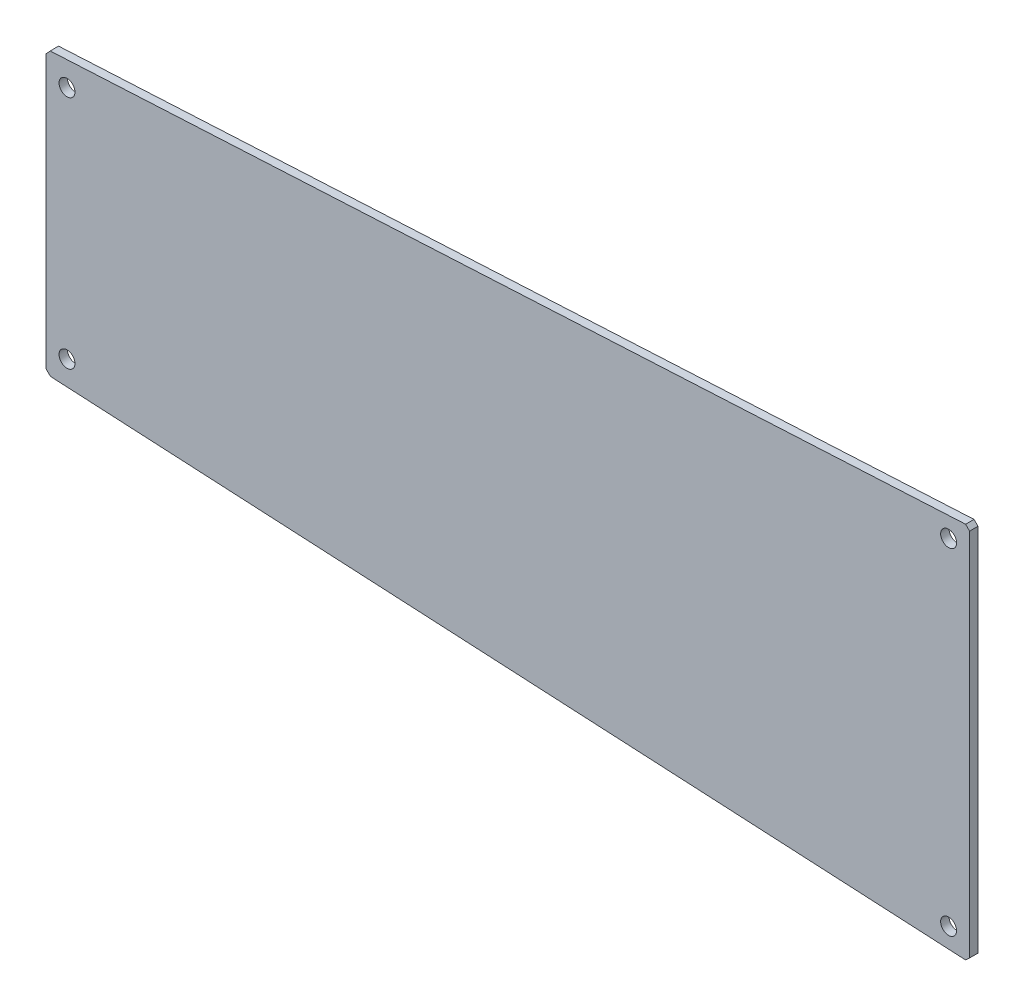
from build123d import *

# Parameters (mm, degrees)
ESQUISSE1_R      = 1.9
EXTRUSION1_DEPTH = 2
CHANFREIN1_SIZE  = 1
CHANFREIN1_SIZE2 = 1.056596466
CHANFREIN2_SIZE  = 1
CHANFREIN2_SIZE2 = 1.056596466
CHANFREIN4_SIZE  = 1
CHANFREIN4_SIZE2 = 0.951621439
CHANFREIN5_SIZE  = 1
CHANFREIN5_SIZE2 = 0.951621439


with BuildPart() as part:
    # Esquisse1 → Extrusion1 (new body)
    with BuildSketch(Plane.XY):
        Polygon((32.89280914, 0), (32.89280914, 45), (-187.10719086, 33.5), (-187.10719086, 0), align=None)
        with Locations((-182.10719086, 28)):
            Circle(ESQUISSE1_R, mode=Mode.SUBTRACT)
        with Locations((27.89280914, 40)):
            Circle(ESQUISSE1_R, mode=Mode.SUBTRACT)
    extrude(amount=EXTRUSION1_DEPTH)

    # Sym_trie1: part across plane


with BuildPart() as part_1:
    add(part.part)
    add(part.part.mirror(Plane(origin=(32.89280914, 0, 2), x_dir=(0, 0, 1), z_dir=(0, 1, 0))))

    # Chanfrein1
    chanfrein1_edges = [part_1.edges().sort_by_distance(p)[0] for p in [
        (-187.10719086, 33.5, 1),
    ]]
    chanfrein1_side = [part_1.faces().sort_by_distance(p)[0] for p in [
        (-77.10719086, 39.25, 1),
    ]]
    chamfer(chanfrein1_edges, length=CHANFREIN1_SIZE, length2=CHANFREIN1_SIZE2, reference=chanfrein1_side[0])

    # Chanfrein2
    chanfrein2_edges = [part_1.edges().sort_by_distance(p)[0] for p in [
        (-187.10719086, -33.5, 1),
    ]]
    chanfrein2_side = [part_1.faces().sort_by_distance(p)[0] for p in [
        (-187.10719086, -0.528298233, 1),
    ]]
    chamfer(chanfrein2_edges, length=CHANFREIN2_SIZE, length2=CHANFREIN2_SIZE2, reference=chanfrein2_side[0])

    # Chanfrein4
    chanfrein4_edges = [part_1.edges().sort_by_distance(p)[0] for p in [
        (32.89280914, -45, 1),
    ]]
    chanfrein4_side = [part_1.faces().sort_by_distance(p)[0] for p in [
        (-76.579612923, -39.277577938, 1),
    ]]
    chamfer(chanfrein4_edges, length=CHANFREIN4_SIZE, length2=CHANFREIN4_SIZE2, reference=chanfrein4_side[0])

    # Chanfrein5
    chanfrein5_edges = [part_1.edges().sort_by_distance(p)[0] for p in [
        (32.89280914, 45, 1),
    ]]
    chanfrein5_side = [part_1.faces().sort_by_distance(p)[0] for p in [
        (32.89280914, 0.47581072, 1),
    ]]
    chamfer(chanfrein5_edges, length=CHANFREIN5_SIZE, length2=CHANFREIN5_SIZE2, reference=chanfrein5_side[0])


solid = part_1.part
